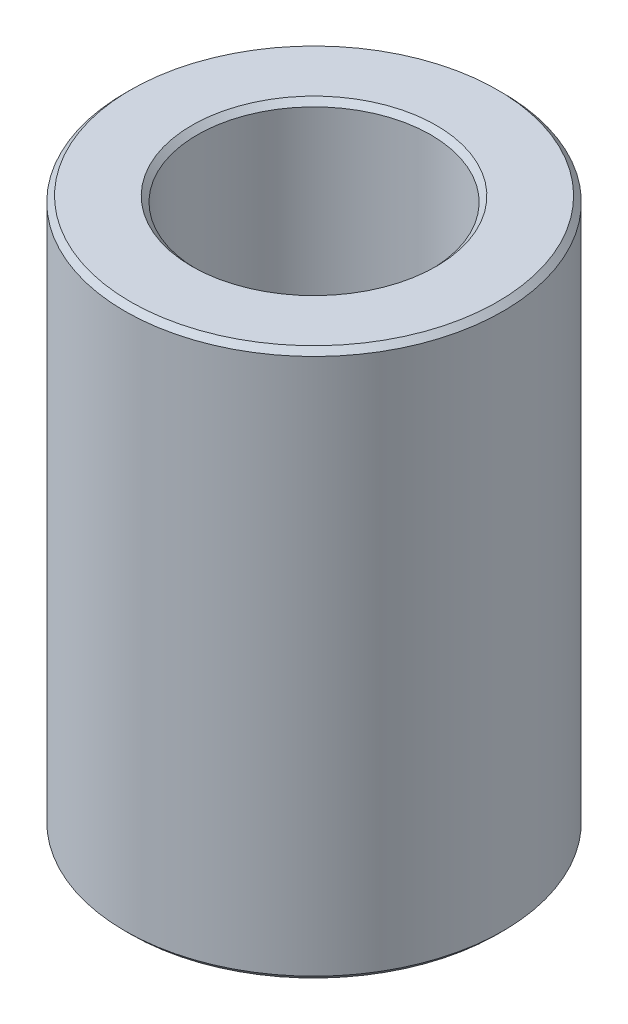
from build123d import *

# Parameters (mm, degrees)
SKETCH2_R           = 8.636
SKETCH2_R_2         = 5.334
EXTRUDE_THIN1_DEPTH = 12.51
CHAMFER1_SIZE       = 0.25


with BuildPart() as part:
    # Sketch2 → Extrude-Thin1 (new, symmetric)
    with BuildSketch(Plane(origin=(0, 0, 0), x_dir=(1, 0, 0), z_dir=(0, 1, 0))):
        Circle(SKETCH2_R)
        Circle(SKETCH2_R_2, mode=Mode.SUBTRACT)
    extrude(amount=EXTRUDE_THIN1_DEPTH, both=True)

    # Chamfer1
    chamfer1_edges = [part.edges().sort_by_distance(p)[0] for p in [
        (-8.636, -12.51, 0),
        (-8.636, 12.51, 0),
        (-5.334, -12.51, 0),
        (-5.334, 12.51, 0),
    ]]
    chamfer(chamfer1_edges, length=CHAMFER1_SIZE)


solid = part.part
